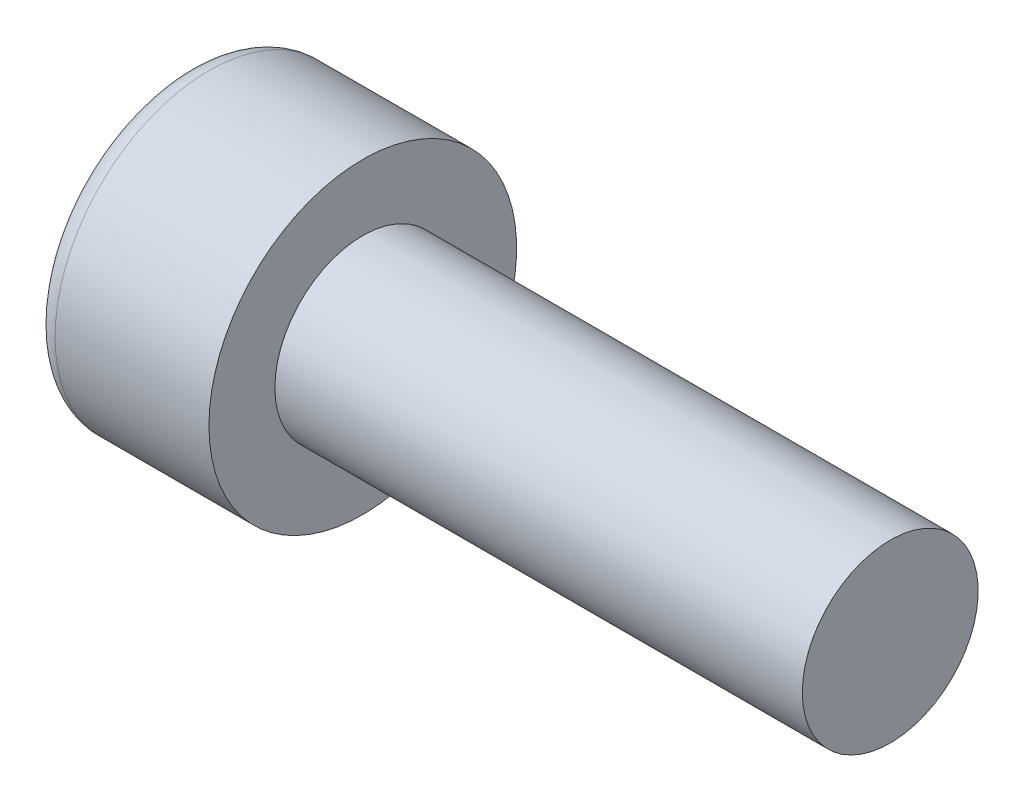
ISO-10303-21;
HEADER;
FILE_DESCRIPTION(('STEP AP214'),'2;1');
FILE_NAME('part.step','',(''),(''),'','','');
FILE_SCHEMA(('AUTOMOTIVE_DESIGN { 1 0 10303 214 1 1 1 1 }'));
ENDSEC;
DATA;
#1=APPLICATION_CONTEXT('core data for automotive mechanical design processes');
#2=APPLICATION_PROTOCOL_DEFINITION('international standard','automotive_design',2000,#1);
#3=PRODUCT_CONTEXT('',#1,'mechanical');
#4=PRODUCT('Part','Part','',(#3));
#5=PRODUCT_RELATED_PRODUCT_CATEGORY('part','',(#4));
#6=PRODUCT_DEFINITION_FORMATION('','',#4);
#7=PRODUCT_DEFINITION_CONTEXT('part definition',#1,'design');
#8=PRODUCT_DEFINITION('design','',#6,#7);
#9=PRODUCT_DEFINITION_SHAPE('','',#8);
#10=(LENGTH_UNIT() NAMED_UNIT(*) SI_UNIT(.MILLI.,.METRE.));
#11=(NAMED_UNIT(*) PLANE_ANGLE_UNIT() SI_UNIT($,.RADIAN.));
#12=(NAMED_UNIT(*) SI_UNIT($,.STERADIAN.) SOLID_ANGLE_UNIT());
#13=UNCERTAINTY_MEASURE_WITH_UNIT(LENGTH_MEASURE(1.E-05),#10,'distance_accuracy_value','');
#14=(GEOMETRIC_REPRESENTATION_CONTEXT(3) GLOBAL_UNCERTAINTY_ASSIGNED_CONTEXT((#13)) GLOBAL_UNIT_ASSIGNED_CONTEXT((#10,
#11,#12)) REPRESENTATION_CONTEXT('',''));
#15=CARTESIAN_POINT('',(0.,0.,0.));
#16=DIRECTION('',(0.,0.,1.));
#17=DIRECTION('',(1.,0.,0.));
#18=AXIS2_PLACEMENT_3D('',#15,#16,#17);
#19=CARTESIAN_POINT('',(-12.,3.5,0.));
#20=DIRECTION('',(-1.,0.,0.));
#21=DIRECTION('',(0.,0.,1.));
#22=AXIS2_PLACEMENT_3D('',#19,#20,#21);
#23=PLANE('',#22);
#24=CARTESIAN_POINT('',(-12.,0.,0.));
#25=DIRECTION('',(-1.,0.,0.));
#26=DIRECTION('',(0.,0.,1.));
#27=AXIS2_PLACEMENT_3D('',#24,#25,#26);
#28=CIRCLE('',#27,3.5);
#29=CARTESIAN_POINT('',(-12.,0.,3.5));
#30=VERTEX_POINT('',#29);
#31=EDGE_CURVE('E149',#30,#30,#28,.T.);
#32=ORIENTED_EDGE('',*,*,#31,.F.);
#33=EDGE_LOOP('',(#32));
#34=FACE_BOUND('',#33,.T.);
#35=CARTESIAN_POINT('',(-12.,0.,0.));
#36=DIRECTION('',(-1.,0.,0.));
#37=DIRECTION('',(0.,0.,1.));
#38=AXIS2_PLACEMENT_3D('',#35,#36,#37);
#39=CIRCLE('',#38,2.);
#40=CARTESIAN_POINT('',(-12.,0.,2.));
#41=VERTEX_POINT('',#40);
#42=EDGE_CURVE('E138',#41,#41,#39,.T.);
#43=ORIENTED_EDGE('',*,*,#42,.T.);
#44=EDGE_LOOP('',(#43));
#45=FACE_BOUND('',#44,.T.);
#46=ADVANCED_FACE('F36',(#34,#45),#23,.F.);
#47=CARTESIAN_POINT('',(-65.0118083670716,0.,0.));
#48=DIRECTION('',(-1.,0.,0.));
#49=DIRECTION('',(0.,0.,1.));
#50=AXIS2_PLACEMENT_3D('',#47,#48,#49);
#51=CYLINDRICAL_SURFACE('',#50,3.5);
#52=CARTESIAN_POINT('',(-15.5,0.,0.));
#53=DIRECTION('',(1.,0.,0.));
#54=DIRECTION('',(0.,0.,-1.));
#55=AXIS2_PLACEMENT_3D('',#52,#53,#54);
#56=CIRCLE('',#55,3.5);
#57=CARTESIAN_POINT('',(-15.5,0.,-3.5));
#58=VERTEX_POINT('',#57);
#59=EDGE_CURVE('E11',#58,#58,#56,.T.);
#60=ORIENTED_EDGE('',*,*,#59,.T.);
#61=EDGE_LOOP('',(#60));
#62=FACE_BOUND('',#61,.T.);
#63=ORIENTED_EDGE('',*,*,#31,.T.);
#64=EDGE_LOOP('',(#63));
#65=FACE_BOUND('',#64,.T.);
#66=ADVANCED_FACE('F171',(#62,#65),#51,.T.);
#67=CARTESIAN_POINT('',(-16.,0.,0.));
#68=DIRECTION('',(1.,0.,0.));
#69=DIRECTION('',(0.,0.,-1.));
#70=AXIS2_PLACEMENT_3D('',#67,#68,#69);
#71=PLANE('',#70);
#72=DIRECTION('',(0.,0.5,-0.866025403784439));
#73=VECTOR('',#72,1.);
#74=CARTESIAN_POINT('',(-16.,0.866025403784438,1.5));
#75=LINE('',#74,#73);
#76=CARTESIAN_POINT('',(-16.,0.866025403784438,1.5));
#77=VERTEX_POINT('',#76);
#78=CARTESIAN_POINT('',(-16.,1.73205080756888,0.));
#79=VERTEX_POINT('',#78);
#80=EDGE_CURVE('E125',#77,#79,#75,.T.);
#81=ORIENTED_EDGE('',*,*,#80,.F.);
#82=DIRECTION('',(0.,1.,0.));
#83=VECTOR('',#82,1.);
#84=CARTESIAN_POINT('',(-16.,-0.86602540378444,1.5));
#85=LINE('',#84,#83);
#86=CARTESIAN_POINT('',(-16.,-0.86602540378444,1.5));
#87=VERTEX_POINT('',#86);
#88=EDGE_CURVE('E51',#87,#77,#85,.T.);
#89=ORIENTED_EDGE('',*,*,#88,.F.);
#90=DIRECTION('',(0.,0.5,0.866025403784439));
#91=VECTOR('',#90,1.);
#92=CARTESIAN_POINT('',(-16.,-1.73205080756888,0.));
#93=LINE('',#92,#91);
#94=CARTESIAN_POINT('',(-16.,-1.73205080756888,0.));
#95=VERTEX_POINT('',#94);
#96=EDGE_CURVE('E134',#95,#87,#93,.T.);
#97=ORIENTED_EDGE('',*,*,#96,.F.);
#98=DIRECTION('',(0.,-0.5,0.866025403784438));
#99=VECTOR('',#98,1.);
#100=CARTESIAN_POINT('',(-16.,-0.866025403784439,-1.5));
#101=LINE('',#100,#99);
#102=CARTESIAN_POINT('',(-16.,-0.866025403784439,-1.5));
#103=VERTEX_POINT('',#102);
#104=EDGE_CURVE('E132',#103,#95,#101,.T.);
#105=ORIENTED_EDGE('',*,*,#104,.F.);
#106=DIRECTION('',(0.,-1.,0.));
#107=VECTOR('',#106,1.);
#108=CARTESIAN_POINT('',(-16.,0.866025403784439,-1.5));
#109=LINE('',#108,#107);
#110=CARTESIAN_POINT('',(-16.,0.866025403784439,-1.5));
#111=VERTEX_POINT('',#110);
#112=EDGE_CURVE('E99',#111,#103,#109,.T.);
#113=ORIENTED_EDGE('',*,*,#112,.F.);
#114=DIRECTION('',(0.,-0.5,-0.866025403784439));
#115=VECTOR('',#114,1.);
#116=CARTESIAN_POINT('',(-16.,1.73205080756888,0.));
#117=LINE('',#116,#115);
#118=EDGE_CURVE('E128',#79,#111,#117,.T.);
#119=ORIENTED_EDGE('',*,*,#118,.F.);
#120=EDGE_LOOP('',(#81,#89,#97,#105,#113,#119));
#121=FACE_BOUND('',#120,.T.);
#122=CARTESIAN_POINT('',(-16.,0.,0.));
#123=DIRECTION('',(1.,0.,0.));
#124=DIRECTION('',(0.,0.,-1.));
#125=AXIS2_PLACEMENT_3D('',#122,#123,#124);
#126=CIRCLE('',#125,3.);
#127=CARTESIAN_POINT('',(-16.,0.,-3.));
#128=VERTEX_POINT('',#127);
#129=EDGE_CURVE('E44',#128,#128,#126,.F.);
#130=ORIENTED_EDGE('',*,*,#129,.T.);
#131=EDGE_LOOP('',(#130));
#132=FACE_BOUND('',#131,.T.);
#133=ADVANCED_FACE('F154',(#121,#132),#71,.F.);
#134=CARTESIAN_POINT('',(0.,2.,0.));
#135=DIRECTION('',(-1.,0.,0.));
#136=DIRECTION('',(0.,0.,1.));
#137=AXIS2_PLACEMENT_3D('',#134,#135,#136);
#138=PLANE('',#137);
#139=CARTESIAN_POINT('',(0.,0.,0.));
#140=DIRECTION('',(-1.,0.,0.));
#141=DIRECTION('',(0.,0.,1.));
#142=AXIS2_PLACEMENT_3D('',#139,#140,#141);
#143=CIRCLE('',#142,2.);
#144=CARTESIAN_POINT('',(0.,0.,2.));
#145=VERTEX_POINT('',#144);
#146=EDGE_CURVE('E146',#145,#145,#143,.T.);
#147=ORIENTED_EDGE('',*,*,#146,.F.);
#148=EDGE_LOOP('',(#147));
#149=FACE_BOUND('',#148,.T.);
#150=ADVANCED_FACE('F166',(#149),#138,.F.);
#151=CARTESIAN_POINT('',(-65.0118083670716,0.,0.));
#152=DIRECTION('',(-1.,0.,0.));
#153=DIRECTION('',(0.,0.,1.));
#154=AXIS2_PLACEMENT_3D('',#151,#152,#153);
#155=CYLINDRICAL_SURFACE('',#154,2.);
#156=ORIENTED_EDGE('',*,*,#42,.F.);
#157=EDGE_LOOP('',(#156));
#158=FACE_BOUND('',#157,.T.);
#159=ORIENTED_EDGE('',*,*,#146,.T.);
#160=EDGE_LOOP('',(#159));
#161=FACE_BOUND('',#160,.T.);
#162=ADVANCED_FACE('F158',(#158,#161),#155,.T.);
#163=CARTESIAN_POINT('',(-15.5,0.,0.));
#164=DIRECTION('',(1.,0.,0.));
#165=DIRECTION('',(0.,0.,-1.));
#166=AXIS2_PLACEMENT_3D('',#163,#164,#165);
#167=TOROIDAL_SURFACE('',#166,3.,0.5);
#168=ORIENTED_EDGE('',*,*,#59,.F.);
#169=EDGE_LOOP('',(#168));
#170=FACE_BOUND('',#169,.T.);
#171=ORIENTED_EDGE('',*,*,#129,.F.);
#172=EDGE_LOOP('',(#171));
#173=FACE_BOUND('',#172,.T.);
#174=ADVANCED_FACE('F38',(#170,#173),#167,.T.);
#175=CARTESIAN_POINT('',(-13.,-0.86602540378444,1.5));
#176=DIRECTION('',(0.,0.,1.));
#177=DIRECTION('',(0.,-1.,0.));
#178=AXIS2_PLACEMENT_3D('',#175,#176,#177);
#179=PLANE('',#178);
#180=ORIENTED_EDGE('',*,*,#88,.T.);
#181=DIRECTION('',(-1.,0.,0.));
#182=VECTOR('',#181,1.);
#183=CARTESIAN_POINT('',(-13.,0.866025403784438,1.5));
#184=LINE('',#183,#182);
#185=CARTESIAN_POINT('',(-13.,0.866025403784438,1.5));
#186=VERTEX_POINT('',#185);
#187=EDGE_CURVE('E81',#186,#77,#184,.T.);
#188=ORIENTED_EDGE('',*,*,#187,.F.);
#189=DIRECTION('',(0.,1.,0.));
#190=VECTOR('',#189,1.);
#191=CARTESIAN_POINT('',(-13.,-0.86602540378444,1.5));
#192=LINE('',#191,#190);
#193=CARTESIAN_POINT('',(-13.,-0.86602540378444,1.5));
#194=VERTEX_POINT('',#193);
#195=EDGE_CURVE('E136',#194,#186,#192,.T.);
#196=ORIENTED_EDGE('',*,*,#195,.F.);
#197=DIRECTION('',(-1.,0.,0.));
#198=VECTOR('',#197,1.);
#199=CARTESIAN_POINT('',(-13.,-0.86602540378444,1.5));
#200=LINE('',#199,#198);
#201=EDGE_CURVE('E59',#194,#87,#200,.T.);
#202=ORIENTED_EDGE('',*,*,#201,.T.);
#203=EDGE_LOOP('',(#180,#188,#196,#202));
#204=FACE_BOUND('',#203,.T.);
#205=ADVANCED_FACE('F157',(#204),#179,.F.);
#206=CARTESIAN_POINT('',(-13.,-1.73205080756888,0.));
#207=DIRECTION('',(0.,-0.866025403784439,0.5));
#208=DIRECTION('',(0.,-0.5,-0.866025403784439));
#209=AXIS2_PLACEMENT_3D('',#206,#207,#208);
#210=PLANE('',#209);
#211=ORIENTED_EDGE('',*,*,#96,.T.);
#212=ORIENTED_EDGE('',*,*,#201,.F.);
#213=DIRECTION('',(0.,0.5,0.866025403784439));
#214=VECTOR('',#213,1.);
#215=CARTESIAN_POINT('',(-13.,-1.73205080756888,0.));
#216=LINE('',#215,#214);
#217=CARTESIAN_POINT('',(-13.,-1.73205080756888,0.));
#218=VERTEX_POINT('',#217);
#219=EDGE_CURVE('E111',#218,#194,#216,.T.);
#220=ORIENTED_EDGE('',*,*,#219,.F.);
#221=DIRECTION('',(-1.,0.,0.));
#222=VECTOR('',#221,1.);
#223=CARTESIAN_POINT('',(-13.,-1.73205080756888,0.));
#224=LINE('',#223,#222);
#225=EDGE_CURVE('E103',#218,#95,#224,.T.);
#226=ORIENTED_EDGE('',*,*,#225,.T.);
#227=EDGE_LOOP('',(#211,#212,#220,#226));
#228=FACE_BOUND('',#227,.T.);
#229=ADVANCED_FACE('F164',(#228),#210,.F.);
#230=CARTESIAN_POINT('',(-13.,-0.866025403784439,-1.5));
#231=DIRECTION('',(0.,-0.866025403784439,-0.5));
#232=DIRECTION('',(0.,0.5,-0.866025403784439));
#233=AXIS2_PLACEMENT_3D('',#230,#231,#232);
#234=PLANE('',#233);
#235=ORIENTED_EDGE('',*,*,#104,.T.);
#236=ORIENTED_EDGE('',*,*,#225,.F.);
#237=DIRECTION('',(0.,-0.5,0.866025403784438));
#238=VECTOR('',#237,1.);
#239=CARTESIAN_POINT('',(-13.,-0.866025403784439,-1.5));
#240=LINE('',#239,#238);
#241=CARTESIAN_POINT('',(-13.,-0.866025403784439,-1.5));
#242=VERTEX_POINT('',#241);
#243=EDGE_CURVE('E107',#242,#218,#240,.T.);
#244=ORIENTED_EDGE('',*,*,#243,.F.);
#245=DIRECTION('',(-1.,0.,0.));
#246=VECTOR('',#245,1.);
#247=CARTESIAN_POINT('',(-13.,-0.866025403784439,-1.5));
#248=LINE('',#247,#246);
#249=EDGE_CURVE('E92',#242,#103,#248,.T.);
#250=ORIENTED_EDGE('',*,*,#249,.T.);
#251=EDGE_LOOP('',(#235,#236,#244,#250));
#252=FACE_BOUND('',#251,.T.);
#253=ADVANCED_FACE('F108',(#252),#234,.F.);
#254=CARTESIAN_POINT('',(-13.,0.866025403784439,-1.5));
#255=DIRECTION('',(0.,0.,-1.));
#256=DIRECTION('',(-1.,0.,0.));
#257=AXIS2_PLACEMENT_3D('',#254,#255,#256);
#258=PLANE('',#257);
#259=ORIENTED_EDGE('',*,*,#112,.T.);
#260=ORIENTED_EDGE('',*,*,#249,.F.);
#261=DIRECTION('',(0.,-1.,0.));
#262=VECTOR('',#261,1.);
#263=CARTESIAN_POINT('',(-13.,0.866025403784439,-1.5));
#264=LINE('',#263,#262);
#265=CARTESIAN_POINT('',(-13.,0.866025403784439,-1.5));
#266=VERTEX_POINT('',#265);
#267=EDGE_CURVE('E96',#266,#242,#264,.T.);
#268=ORIENTED_EDGE('',*,*,#267,.F.);
#269=DIRECTION('',(-1.,0.,0.));
#270=VECTOR('',#269,1.);
#271=CARTESIAN_POINT('',(-13.,0.866025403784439,-1.5));
#272=LINE('',#271,#270);
#273=EDGE_CURVE('E104',#266,#111,#272,.T.);
#274=ORIENTED_EDGE('',*,*,#273,.T.);
#275=EDGE_LOOP('',(#259,#260,#268,#274));
#276=FACE_BOUND('',#275,.T.);
#277=ADVANCED_FACE('F94',(#276),#258,.F.);
#278=CARTESIAN_POINT('',(-13.,1.73205080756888,0.));
#279=DIRECTION('',(0.,0.866025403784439,-0.5));
#280=DIRECTION('',(0.,0.5,0.866025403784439));
#281=AXIS2_PLACEMENT_3D('',#278,#279,#280);
#282=PLANE('',#281);
#283=ORIENTED_EDGE('',*,*,#118,.T.);
#284=ORIENTED_EDGE('',*,*,#273,.F.);
#285=DIRECTION('',(0.,-0.5,-0.866025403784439));
#286=VECTOR('',#285,1.);
#287=CARTESIAN_POINT('',(-13.,1.73205080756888,0.));
#288=LINE('',#287,#286);
#289=CARTESIAN_POINT('',(-13.,1.73205080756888,0.));
#290=VERTEX_POINT('',#289);
#291=EDGE_CURVE('E117',#290,#266,#288,.T.);
#292=ORIENTED_EDGE('',*,*,#291,.F.);
#293=DIRECTION('',(-1.,0.,0.));
#294=VECTOR('',#293,1.);
#295=CARTESIAN_POINT('',(-13.,1.73205080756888,0.));
#296=LINE('',#295,#294);
#297=EDGE_CURVE('E141',#290,#79,#296,.T.);
#298=ORIENTED_EDGE('',*,*,#297,.T.);
#299=EDGE_LOOP('',(#283,#284,#292,#298));
#300=FACE_BOUND('',#299,.T.);
#301=ADVANCED_FACE('F190',(#300),#282,.F.);
#302=CARTESIAN_POINT('',(-13.,0.866025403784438,1.5));
#303=DIRECTION('',(0.,0.866025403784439,0.5));
#304=DIRECTION('',(0.,-0.5,0.866025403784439));
#305=AXIS2_PLACEMENT_3D('',#302,#303,#304);
#306=PLANE('',#305);
#307=ORIENTED_EDGE('',*,*,#80,.T.);
#308=ORIENTED_EDGE('',*,*,#297,.F.);
#309=DIRECTION('',(0.,0.5,-0.866025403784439));
#310=VECTOR('',#309,1.);
#311=CARTESIAN_POINT('',(-13.,0.866025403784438,1.5));
#312=LINE('',#311,#310);
#313=EDGE_CURVE('E119',#186,#290,#312,.T.);
#314=ORIENTED_EDGE('',*,*,#313,.F.);
#315=ORIENTED_EDGE('',*,*,#187,.T.);
#316=EDGE_LOOP('',(#307,#308,#314,#315));
#317=FACE_BOUND('',#316,.T.);
#318=ADVANCED_FACE('F187',(#317),#306,.F.);
#319=CARTESIAN_POINT('',(-13.,0.,0.));
#320=DIRECTION('',(-1.,0.,0.));
#321=DIRECTION('',(0.,0.,1.));
#322=AXIS2_PLACEMENT_3D('',#319,#320,#321);
#323=PLANE('',#322);
#324=ORIENTED_EDGE('',*,*,#195,.T.);
#325=ORIENTED_EDGE('',*,*,#313,.T.);
#326=ORIENTED_EDGE('',*,*,#291,.T.);
#327=ORIENTED_EDGE('',*,*,#267,.T.);
#328=ORIENTED_EDGE('',*,*,#243,.T.);
#329=ORIENTED_EDGE('',*,*,#219,.T.);
#330=EDGE_LOOP('',(#324,#325,#326,#327,#328,#329));
#331=FACE_BOUND('',#330,.T.);
#332=ADVANCED_FACE('F114',(#331),#323,.T.);
#333=CLOSED_SHELL('',(#46,#66,#133,#150,#162,#174,#205,#229,#253,#277,#301,#318,#332));
#334=MANIFOLD_SOLID_BREP('B2',#333);
#335=ADVANCED_BREP_SHAPE_REPRESENTATION('',(#18,#334),#14);
#336=SHAPE_DEFINITION_REPRESENTATION(#9,#335);
ENDSEC;
END-ISO-10303-21;
